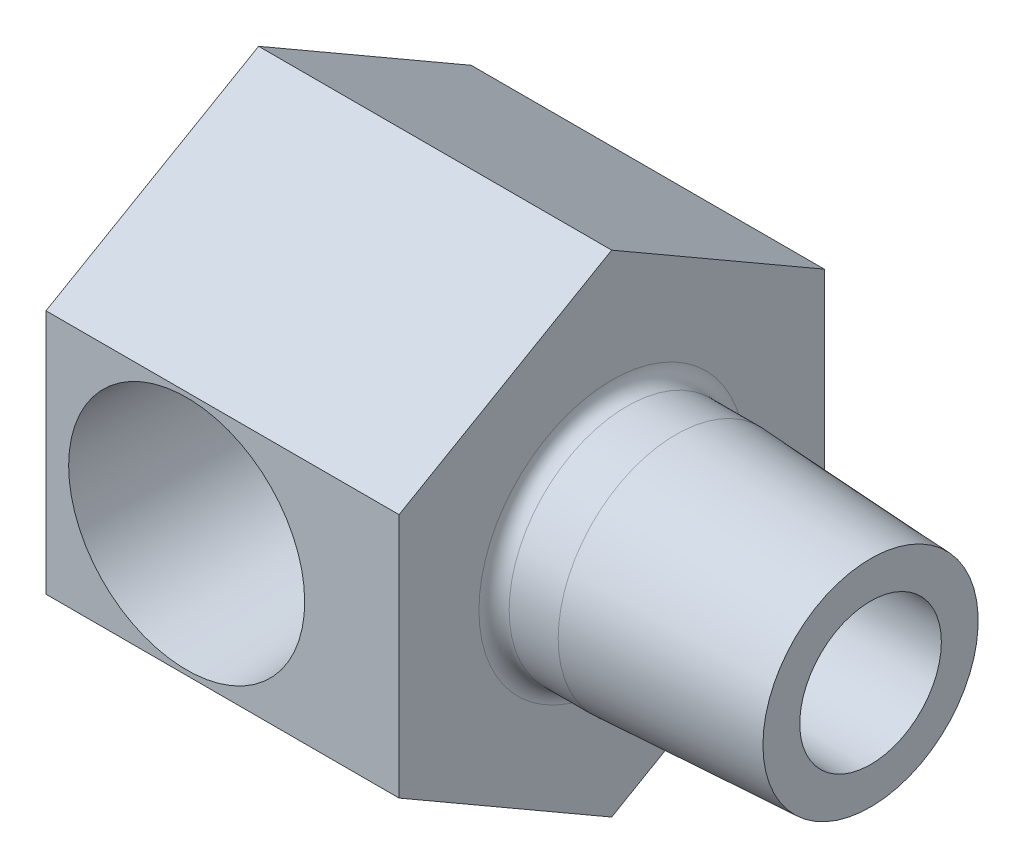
ISO-10303-21;
HEADER;
FILE_DESCRIPTION(('STEP AP214'),'2;1');
FILE_NAME('part.step','',(''),(''),'','','');
FILE_SCHEMA(('AUTOMOTIVE_DESIGN { 1 0 10303 214 1 1 1 1 }'));
ENDSEC;
DATA;
#1=APPLICATION_CONTEXT('core data for automotive mechanical design processes');
#2=APPLICATION_PROTOCOL_DEFINITION('international standard','automotive_design',2000,#1);
#3=PRODUCT_CONTEXT('',#1,'mechanical');
#4=PRODUCT('Part','Part','',(#3));
#5=PRODUCT_RELATED_PRODUCT_CATEGORY('part','',(#4));
#6=PRODUCT_DEFINITION_FORMATION('','',#4);
#7=PRODUCT_DEFINITION_CONTEXT('part definition',#1,'design');
#8=PRODUCT_DEFINITION('design','',#6,#7);
#9=PRODUCT_DEFINITION_SHAPE('','',#8);
#10=(LENGTH_UNIT() NAMED_UNIT(*) SI_UNIT(.MILLI.,.METRE.));
#11=(NAMED_UNIT(*) PLANE_ANGLE_UNIT() SI_UNIT($,.RADIAN.));
#12=(NAMED_UNIT(*) SI_UNIT($,.STERADIAN.) SOLID_ANGLE_UNIT());
#13=UNCERTAINTY_MEASURE_WITH_UNIT(LENGTH_MEASURE(1.E-05),#10,'distance_accuracy_value','');
#14=(GEOMETRIC_REPRESENTATION_CONTEXT(3) GLOBAL_UNCERTAINTY_ASSIGNED_CONTEXT((#13)) GLOBAL_UNIT_ASSIGNED_CONTEXT((#10,
#11,#12)) REPRESENTATION_CONTEXT('',''));
#15=CARTESIAN_POINT('',(0.,0.,0.));
#16=DIRECTION('',(0.,0.,1.));
#17=DIRECTION('',(1.,0.,0.));
#18=AXIS2_PLACEMENT_3D('',#15,#16,#17);
#19=CARTESIAN_POINT('',(6.54292177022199,0.,0.));
#20=DIRECTION('',(-1.,0.,0.));
#21=DIRECTION('',(0.,0.,1.));
#22=AXIS2_PLACEMENT_3D('',#19,#20,#21);
#23=PLANE('',#22);
#24=CARTESIAN_POINT('',(6.54292177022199,0.,0.));
#25=DIRECTION('',(1.,0.,0.));
#26=DIRECTION('',(0.,0.,-1.));
#27=AXIS2_PLACEMENT_3D('',#24,#25,#26);
#28=CIRCLE('',#27,2.38125);
#29=CARTESIAN_POINT('',(6.54292177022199,0.,-2.38125));
#30=VERTEX_POINT('',#29);
#31=EDGE_CURVE('E219',#30,#30,#28,.T.);
#32=ORIENTED_EDGE('',*,*,#31,.F.);
#33=EDGE_LOOP('',(#32));
#34=FACE_BOUND('',#33,.T.);
#35=CARTESIAN_POINT('',(6.54292177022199,0.,0.));
#36=DIRECTION('',(-1.,0.,0.));
#37=DIRECTION('',(0.,0.,1.));
#38=AXIS2_PLACEMENT_3D('',#35,#36,#37);
#39=CIRCLE('',#38,3.6195);
#40=CARTESIAN_POINT('',(6.54292177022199,0.,3.6195));
#41=VERTEX_POINT('',#40);
#42=EDGE_CURVE('E222',#41,#41,#39,.T.);
#43=ORIENTED_EDGE('',*,*,#42,.F.);
#44=EDGE_LOOP('',(#43));
#45=FACE_BOUND('',#44,.T.);
#46=ADVANCED_FACE('F14',(#34,#45),#23,.F.);
#47=CARTESIAN_POINT('',(-9.30032822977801,0.,-2.73832921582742));
#48=DIRECTION('',(0.,0.,1.));
#49=DIRECTION('',(1.,0.,0.));
#50=AXIS2_PLACEMENT_3D('',#47,#48,#49);
#51=CONICAL_SURFACE('',#50,3.175,1.0471975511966);
#52=CARTESIAN_POINT('',(-9.30032822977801,0.,-2.73832921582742));
#53=DIRECTION('',(0.,0.,-1.));
#54=DIRECTION('',(-1.,0.,0.));
#55=AXIS2_PLACEMENT_3D('',#52,#53,#54);
#56=CIRCLE('',#55,3.175);
#57=CARTESIAN_POINT('',(-12.475328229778,0.,-2.73832921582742));
#58=VERTEX_POINT('',#57);
#59=EDGE_CURVE('E216',#58,#58,#56,.T.);
#60=ORIENTED_EDGE('',*,*,#59,.F.);
#61=EDGE_LOOP('',(#60));
#62=FACE_BOUND('',#61,.T.);
#63=CARTESIAN_POINT('',(-9.30032822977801,0.,-4.57141632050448));
#64=VERTEX_POINT('',#63);
#65=VERTEX_LOOP('',#64);
#66=FACE_BOUND('',#65,.T.);
#67=ADVANCED_FACE('F146',(#62,#66),#51,.F.);
#68=CARTESIAN_POINT('',(-9.30032822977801,0.,8.8617196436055));
#69=DIRECTION('',(0.,0.,-1.));
#70=DIRECTION('',(-1.,0.,0.));
#71=AXIS2_PLACEMENT_3D('',#68,#69,#70);
#72=CYLINDRICAL_SURFACE('',#71,3.175);
#73=CARTESIAN_POINT('',(-7.05526419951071,2.24506403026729,0.79375));
#74=CARTESIAN_POINT('',(-7.07063054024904,2.26043135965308,0.750274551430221));
#75=CARTESIAN_POINT('',(-7.08514897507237,2.27463356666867,0.706092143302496));
#76=CARTESIAN_POINT('',(-7.11211136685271,2.30058256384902,0.616331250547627));
#77=CARTESIAN_POINT('',(-7.12455265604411,2.31232620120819,0.570751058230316));
#78=CARTESIAN_POINT('',(-7.15815243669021,2.34364261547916,0.432038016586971));
#79=CARTESIAN_POINT('',(-7.175561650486,2.35927649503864,0.337000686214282));
#80=CARTESIAN_POINT('',(-7.19757103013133,2.37892390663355,0.143481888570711));
#81=CARTESIAN_POINT('',(-7.20207417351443,2.38284942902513,0.0449799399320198));
#82=CARTESIAN_POINT('',(-7.19711092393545,2.37846744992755,-0.151130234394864));
#83=CARTESIAN_POINT('',(-7.18768047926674,2.37019142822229,-0.248740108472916));
#84=CARTESIAN_POINT('',(-7.15800484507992,2.34337709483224,-0.432242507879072));
#85=CARTESIAN_POINT('',(-7.13872166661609,2.32574702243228,-0.51843534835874));
#86=CARTESIAN_POINT('',(-7.09238154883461,2.28180161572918,-0.686513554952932));
#87=CARTESIAN_POINT('',(-7.06530756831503,2.25546722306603,-0.768389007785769));
#88=CARTESIAN_POINT('',(-6.98731820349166,2.17607706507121,-0.976792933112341));
#89=CARTESIAN_POINT('',(-6.9320756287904,2.11660602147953,-1.09925898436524));
#90=CARTESIAN_POINT('',(-6.81619358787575,1.97934786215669,-1.3306727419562));
#91=CARTESIAN_POINT('',(-6.75554344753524,1.90152399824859,-1.43959264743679));
#92=CARTESIAN_POINT('',(-6.63348909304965,1.72635196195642,-1.6458461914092));
#93=CARTESIAN_POINT('',(-6.57210494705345,1.62855746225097,-1.74281458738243));
#94=CARTESIAN_POINT('',(-6.45575897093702,1.41553245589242,-1.91982421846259));
#95=CARTESIAN_POINT('',(-6.40078566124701,1.30033399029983,-1.99989592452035));
#96=CARTESIAN_POINT('',(-6.31222737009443,1.07850015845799,-2.12604138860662));
#97=CARTESIAN_POINT('',(-6.27656345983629,0.974747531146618,-2.17571119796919));
#98=CARTESIAN_POINT('',(-6.21523096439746,0.758545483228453,-2.26017671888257));
#99=CARTESIAN_POINT('',(-6.18955593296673,0.646101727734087,-2.29498202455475));
#100=CARTESIAN_POINT('',(-6.1502995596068,0.414497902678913,-2.34791955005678));
#101=CARTESIAN_POINT('',(-6.13679344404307,0.295300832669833,-2.36594808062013));
#102=CARTESIAN_POINT('',(-6.12352149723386,0.0547983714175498,-2.38366630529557));
#103=CARTESIAN_POINT('',(-6.1237498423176,-0.0665061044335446,-2.38336377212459));
#104=CARTESIAN_POINT('',(-6.13717423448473,-0.294650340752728,-2.36543762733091));
#105=CARTESIAN_POINT('',(-6.14905872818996,-0.401714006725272,-2.34956584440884));
#106=CARTESIAN_POINT('',(-6.18290116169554,-0.611174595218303,-2.30397720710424));
#107=CARTESIAN_POINT('',(-6.20486121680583,-0.713570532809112,-2.2742574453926));
#108=CARTESIAN_POINT('',(-6.25817977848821,-0.914983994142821,-2.20114539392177));
#109=CARTESIAN_POINT('',(-6.28983872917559,-1.01375998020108,-2.15731333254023));
#110=CARTESIAN_POINT('',(-6.36014386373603,-1.20253885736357,-2.05806633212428));
#111=CARTESIAN_POINT('',(-6.39879107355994,-1.29254045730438,-2.0026496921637));
#112=CARTESIAN_POINT('',(-6.4877534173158,-1.47723800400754,-1.8716295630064));
#113=CARTESIAN_POINT('',(-6.53893953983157,-1.57021355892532,-1.79420076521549));
#114=CARTESIAN_POINT('',(-6.64447017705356,-1.74278172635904,-1.62712480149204));
#115=CARTESIAN_POINT('',(-6.69882138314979,-1.82234449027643,-1.53745116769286));
#116=CARTESIAN_POINT('',(-6.78483601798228,-1.93799449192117,-1.38549534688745));
#117=CARTESIAN_POINT('',(-6.81678417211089,-1.978649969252,-1.32680472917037));
#118=CARTESIAN_POINT('',(-6.87940523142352,-2.05479804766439,-1.20552687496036));
#119=CARTESIAN_POINT('',(-6.91007766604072,-2.09028875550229,-1.14293822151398));
#120=CARTESIAN_POINT('',(-6.99839934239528,-2.18847351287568,-0.949607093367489));
#121=CARTESIAN_POINT('',(-7.05261796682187,-2.24321798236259,-0.812860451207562));
#122=CARTESIAN_POINT('',(-7.12289034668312,-2.31101796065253,-0.581315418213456));
#123=CARTESIAN_POINT('',(-7.14558921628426,-2.33200721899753,-0.490836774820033));
#124=CARTESIAN_POINT('',(-7.17999291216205,-2.36333509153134,-0.30613691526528));
#125=CARTESIAN_POINT('',(-7.19172795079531,-2.37370298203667,-0.211926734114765));
#126=CARTESIAN_POINT('',(-7.20230295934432,-2.38306079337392,-0.0217499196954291));
#127=CARTESIAN_POINT('',(-7.20108262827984,-2.3819975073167,0.0742228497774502));
#128=CARTESIAN_POINT('',(-7.18580389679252,-2.36843856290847,0.264544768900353));
#129=CARTESIAN_POINT('',(-7.1717105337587,-2.35591176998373,0.358888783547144));
#130=CARTESIAN_POINT('',(-7.13993777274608,-2.32671680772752,0.510301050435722));
#131=CARTESIAN_POINT('',(-7.12532517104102,-2.31311442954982,0.568673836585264));
#132=CARTESIAN_POINT('',(-7.09266493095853,-2.281962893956,0.682993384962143));
#133=CARTESIAN_POINT('',(-7.07463742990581,-2.26443676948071,0.738952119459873));
#134=CARTESIAN_POINT('',(-7.05526419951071,-2.24506403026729,0.79375));
#135=B_SPLINE_CURVE_WITH_KNOTS('',3,(#73,#74,#75,#76,#77,#78,#79,#80,#81,#82,#83,#84,#85,#86,
#87,#88,#89,#90,#91,#92,#93,#94,#95,#96,#97,#98,#99,#100,#101,#102,#103,#104,#105,#106,#107,
#108,#109,#110,#111,#112,#113,#114,#115,#116,#117,#118,#119,#120,#121,#122,#123,#124,#125,#126,
#127,#128,#129,#130,#131,#132,#133,#134),.UNSPECIFIED.,.F.,.F.,(4,2,2,2,2,2,2,2,2,2,2,2,2,2,2,2,
2,2,2,2,2,2,2,2,2,2,2,2,2,2,4),(0.,0.145766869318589,0.291719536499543,0.583852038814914,
0.878174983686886,1.17173990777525,1.44095267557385,1.71075884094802,2.14913753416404,
2.58840156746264,3.0388403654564,3.48845978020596,3.84830623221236,4.20792007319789,
4.56974203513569,4.93141057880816,5.25656488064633,5.58178747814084,5.91832668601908,
6.25491534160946,6.64763851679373,7.04122443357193,7.27561367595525,7.51008862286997,
7.9772178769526,8.26303342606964,8.54805902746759,8.83441186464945,9.12154474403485,
9.30637335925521,9.49014419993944),.UNSPECIFIED.);
#136=CARTESIAN_POINT('',(-7.05526419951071,2.24506403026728,0.79375));
#137=VERTEX_POINT('',#136);
#138=CARTESIAN_POINT('',(-7.05526419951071,-2.24506403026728,0.79375));
#139=VERTEX_POINT('',#138);
#140=EDGE_CURVE('E9',#137,#139,#135,.T.);
#141=ORIENTED_EDGE('',*,*,#140,.F.);
#142=CARTESIAN_POINT('',(-9.30032822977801,0.,0.79375));
#143=DIRECTION('',(0.,0.,-1.));
#144=DIRECTION('',(-1.,0.,0.));
#145=AXIS2_PLACEMENT_3D('',#142,#143,#144);
#146=CIRCLE('',#145,3.175);
#147=EDGE_CURVE('E211',#139,#137,#146,.T.);
#148=ORIENTED_EDGE('',*,*,#147,.F.);
#149=EDGE_LOOP('',(#141,#148));
#150=FACE_BOUND('',#149,.T.);
#151=ORIENTED_EDGE('',*,*,#59,.T.);
#152=EDGE_LOOP('',(#151));
#153=FACE_BOUND('',#152,.T.);
#154=ADVANCED_FACE('F149',(#150,#153),#72,.F.);
#155=CARTESIAN_POINT('',(-2.15657822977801,4.12811215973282,7.15645));
#156=DIRECTION('',(0.,0.,-1.));
#157=DIRECTION('',(-1.,0.,0.));
#158=AXIS2_PLACEMENT_3D('',#155,#156,#157);
#159=PLANE('',#158);
#160=DIRECTION('',(0.,-1.,0.));
#161=VECTOR('',#160,1.);
#162=CARTESIAN_POINT('',(-14.031078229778,-8.25622431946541,7.15645));
#163=LINE('',#162,#161);
#164=CARTESIAN_POINT('',(-14.031078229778,4.12811215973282,7.15645));
#165=VERTEX_POINT('',#164);
#166=CARTESIAN_POINT('',(-14.031078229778,-4.12811215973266,7.15645));
#167=VERTEX_POINT('',#166);
#168=EDGE_CURVE('E130',#165,#167,#163,.T.);
#169=ORIENTED_EDGE('',*,*,#168,.T.);
#170=DIRECTION('',(-1.,0.,0.));
#171=VECTOR('',#170,1.);
#172=CARTESIAN_POINT('',(-2.15657822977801,-4.12811215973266,7.15645));
#173=LINE('',#172,#171);
#174=CARTESIAN_POINT('',(-2.15657822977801,-4.12811215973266,7.15645));
#175=VERTEX_POINT('',#174);
#176=EDGE_CURVE('E198',#175,#167,#173,.T.);
#177=ORIENTED_EDGE('',*,*,#176,.F.);
#178=DIRECTION('',(0.,-1.,0.));
#179=VECTOR('',#178,1.);
#180=CARTESIAN_POINT('',(-2.15657822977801,4.12811215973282,7.15645));
#181=LINE('',#180,#179);
#182=CARTESIAN_POINT('',(-2.15657822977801,4.12811215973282,7.15645));
#183=VERTEX_POINT('',#182);
#184=EDGE_CURVE('E190',#183,#175,#181,.T.);
#185=ORIENTED_EDGE('',*,*,#184,.F.);
#186=DIRECTION('',(-1.,0.,0.));
#187=VECTOR('',#186,1.);
#188=CARTESIAN_POINT('',(-2.15657822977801,4.12811215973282,7.15645));
#189=LINE('',#188,#187);
#190=EDGE_CURVE('E201',#183,#165,#189,.T.);
#191=ORIENTED_EDGE('',*,*,#190,.T.);
#192=EDGE_LOOP('',(#169,#177,#185,#191));
#193=FACE_BOUND('',#192,.T.);
#194=CARTESIAN_POINT('',(-9.30032822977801,0.,7.15645));
#195=DIRECTION('',(0.,0.,-1.));
#196=DIRECTION('',(-1.,0.,0.));
#197=AXIS2_PLACEMENT_3D('',#194,#195,#196);
#198=CIRCLE('',#197,3.96941557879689);
#199=CARTESIAN_POINT('',(-13.2697438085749,0.,7.15645));
#200=VERTEX_POINT('',#199);
#201=EDGE_CURVE('E121',#200,#200,#198,.T.);
#202=ORIENTED_EDGE('',*,*,#201,.T.);
#203=EDGE_LOOP('',(#202));
#204=FACE_BOUND('',#203,.T.);
#205=ADVANCED_FACE('F158',(#193,#204),#159,.F.);
#206=CARTESIAN_POINT('',(-2.15657822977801,-8.25622431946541,0.00635000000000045));
#207=DIRECTION('',(0.,0.866025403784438,0.5));
#208=DIRECTION('',(0.,-0.5,0.866025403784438));
#209=AXIS2_PLACEMENT_3D('',#206,#207,#208);
#210=PLANE('',#209);
#211=DIRECTION('',(0.,0.5,-0.866025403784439));
#212=VECTOR('',#211,1.);
#213=CARTESIAN_POINT('',(-14.031078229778,-8.25622431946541,0.00635000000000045));
#214=LINE('',#213,#212);
#215=CARTESIAN_POINT('',(-14.031078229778,-8.25622431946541,0.00635000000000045));
#216=VERTEX_POINT('',#215);
#217=CARTESIAN_POINT('',(-14.031078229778,-4.12811215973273,-7.14375));
#218=VERTEX_POINT('',#217);
#219=EDGE_CURVE('E109',#216,#218,#214,.T.);
#220=ORIENTED_EDGE('',*,*,#219,.T.);
#221=DIRECTION('',(-1.,0.,0.));
#222=VECTOR('',#221,1.);
#223=CARTESIAN_POINT('',(-2.15657822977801,-4.12811215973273,-7.14375));
#224=LINE('',#223,#222);
#225=CARTESIAN_POINT('',(-2.15657822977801,-4.12811215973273,-7.14375));
#226=VERTEX_POINT('',#225);
#227=EDGE_CURVE('E88',#226,#218,#224,.T.);
#228=ORIENTED_EDGE('',*,*,#227,.F.);
#229=DIRECTION('',(0.,0.5,-0.866025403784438));
#230=VECTOR('',#229,1.);
#231=CARTESIAN_POINT('',(-2.15657822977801,-8.25622431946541,0.00635000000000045));
#232=LINE('',#231,#230);
#233=CARTESIAN_POINT('',(-2.15657822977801,-8.25622431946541,0.00635000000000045));
#234=VERTEX_POINT('',#233);
#235=EDGE_CURVE('E95',#234,#226,#232,.T.);
#236=ORIENTED_EDGE('',*,*,#235,.F.);
#237=DIRECTION('',(-1.,0.,0.));
#238=VECTOR('',#237,1.);
#239=CARTESIAN_POINT('',(-2.15657822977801,-8.25622431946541,0.00635000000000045));
#240=LINE('',#239,#238);
#241=EDGE_CURVE('E195',#234,#216,#240,.T.);
#242=ORIENTED_EDGE('',*,*,#241,.T.);
#243=EDGE_LOOP('',(#220,#228,#236,#242));
#244=FACE_BOUND('',#243,.T.);
#245=ADVANCED_FACE('F107',(#244),#210,.F.);
#246=CARTESIAN_POINT('',(-2.15657822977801,-4.12811215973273,-7.14375));
#247=DIRECTION('',(0.,0.,1.));
#248=DIRECTION('',(0.,-1.,0.));
#249=AXIS2_PLACEMENT_3D('',#246,#247,#248);
#250=PLANE('',#249);
#251=DIRECTION('',(0.,1.,0.));
#252=VECTOR('',#251,1.);
#253=CARTESIAN_POINT('',(-14.031078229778,-8.25622431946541,-7.14375));
#254=LINE('',#253,#252);
#255=CARTESIAN_POINT('',(-14.031078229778,4.12811215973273,-7.14375));
#256=VERTEX_POINT('',#255);
#257=EDGE_CURVE('E120',#218,#256,#254,.T.);
#258=ORIENTED_EDGE('',*,*,#257,.T.);
#259=DIRECTION('',(-1.,0.,0.));
#260=VECTOR('',#259,1.);
#261=CARTESIAN_POINT('',(-2.15657822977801,4.12811215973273,-7.14375));
#262=LINE('',#261,#260);
#263=CARTESIAN_POINT('',(-2.15657822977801,4.12811215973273,-7.14375));
#264=VERTEX_POINT('',#263);
#265=EDGE_CURVE('E91',#264,#256,#262,.T.);
#266=ORIENTED_EDGE('',*,*,#265,.F.);
#267=DIRECTION('',(0.,1.,0.));
#268=VECTOR('',#267,1.);
#269=CARTESIAN_POINT('',(-2.15657822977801,-4.12811215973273,-7.14375));
#270=LINE('',#269,#268);
#271=EDGE_CURVE('E84',#226,#264,#270,.T.);
#272=ORIENTED_EDGE('',*,*,#271,.F.);
#273=ORIENTED_EDGE('',*,*,#227,.T.);
#274=EDGE_LOOP('',(#258,#266,#272,#273));
#275=FACE_BOUND('',#274,.T.);
#276=ADVANCED_FACE('F86',(#275),#250,.F.);
#277=CARTESIAN_POINT('',(-2.15657822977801,4.12811215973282,-7.14375));
#278=DIRECTION('',(0.,-0.866025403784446,0.499999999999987));
#279=DIRECTION('',(0.,-0.499999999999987,-0.866025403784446));
#280=AXIS2_PLACEMENT_3D('',#277,#278,#279);
#281=PLANE('',#280);
#282=DIRECTION('',(0.,0.499999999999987,0.866025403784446));
#283=VECTOR('',#282,1.);
#284=CARTESIAN_POINT('',(-14.031078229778,4.12811215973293,-7.14374999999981));
#285=LINE('',#284,#283);
#286=CARTESIAN_POINT('',(-14.031078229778,8.25622431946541,0.00635000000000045));
#287=VERTEX_POINT('',#286);
#288=EDGE_CURVE('E124',#256,#287,#285,.T.);
#289=ORIENTED_EDGE('',*,*,#288,.T.);
#290=DIRECTION('',(-1.,0.,0.));
#291=VECTOR('',#290,1.);
#292=CARTESIAN_POINT('',(-2.15657822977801,8.25622431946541,0.00635000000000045));
#293=LINE('',#292,#291);
#294=CARTESIAN_POINT('',(-2.15657822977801,8.25622431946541,0.00635000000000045));
#295=VERTEX_POINT('',#294);
#296=EDGE_CURVE('E114',#295,#287,#293,.T.);
#297=ORIENTED_EDGE('',*,*,#296,.F.);
#298=DIRECTION('',(0.,0.499999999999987,0.866025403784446));
#299=VECTOR('',#298,1.);
#300=CARTESIAN_POINT('',(-2.15657822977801,4.12811215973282,-7.14375));
#301=LINE('',#300,#299);
#302=EDGE_CURVE('E94',#264,#295,#301,.T.);
#303=ORIENTED_EDGE('',*,*,#302,.F.);
#304=ORIENTED_EDGE('',*,*,#265,.T.);
#305=EDGE_LOOP('',(#289,#297,#303,#304));
#306=FACE_BOUND('',#305,.T.);
#307=ADVANCED_FACE('F164',(#306),#281,.F.);
#308=CARTESIAN_POINT('',(-2.15657822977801,8.25622431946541,0.00635000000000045));
#309=DIRECTION('',(0.,-0.866025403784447,-0.499999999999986));
#310=DIRECTION('',(0.,0.499999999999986,-0.866025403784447));
#311=AXIS2_PLACEMENT_3D('',#308,#309,#310);
#312=PLANE('',#311);
#313=DIRECTION('',(0.,-0.499999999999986,0.866025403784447));
#314=VECTOR('',#313,1.);
#315=CARTESIAN_POINT('',(-14.031078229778,4.12811215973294,7.1564499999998));
#316=LINE('',#315,#314);
#317=EDGE_CURVE('E127',#287,#165,#316,.T.);
#318=ORIENTED_EDGE('',*,*,#317,.T.);
#319=ORIENTED_EDGE('',*,*,#190,.F.);
#320=DIRECTION('',(0.,-0.499999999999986,0.866025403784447));
#321=VECTOR('',#320,1.);
#322=CARTESIAN_POINT('',(-2.15657822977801,8.25622431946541,0.00635000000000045));
#323=LINE('',#322,#321);
#324=EDGE_CURVE('E188',#295,#183,#323,.T.);
#325=ORIENTED_EDGE('',*,*,#324,.F.);
#326=ORIENTED_EDGE('',*,*,#296,.T.);
#327=EDGE_LOOP('',(#318,#319,#325,#326));
#328=FACE_BOUND('',#327,.T.);
#329=ADVANCED_FACE('F156',(#328),#312,.F.);
#330=CARTESIAN_POINT('',(-2.15657822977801,-4.12811215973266,7.15645));
#331=DIRECTION('',(0.,0.866025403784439,-0.5));
#332=DIRECTION('',(0.,0.5,0.866025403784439));
#333=AXIS2_PLACEMENT_3D('',#330,#331,#332);
#334=PLANE('',#333);
#335=DIRECTION('',(0.,-0.5,-0.866025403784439));
#336=VECTOR('',#335,1.);
#337=CARTESIAN_POINT('',(-14.031078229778,-8.2562243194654,0.00634999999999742));
#338=LINE('',#337,#336);
#339=EDGE_CURVE('E105',#167,#216,#338,.T.);
#340=ORIENTED_EDGE('',*,*,#339,.T.);
#341=ORIENTED_EDGE('',*,*,#241,.F.);
#342=DIRECTION('',(0.,-0.5,-0.866025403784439));
#343=VECTOR('',#342,1.);
#344=CARTESIAN_POINT('',(-2.15657822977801,-4.12811215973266,7.15645));
#345=LINE('',#344,#343);
#346=EDGE_CURVE('E101',#175,#234,#345,.T.);
#347=ORIENTED_EDGE('',*,*,#346,.F.);
#348=ORIENTED_EDGE('',*,*,#176,.T.);
#349=EDGE_LOOP('',(#340,#341,#347,#348));
#350=FACE_BOUND('',#349,.T.);
#351=ADVANCED_FACE('F153',(#350),#334,.F.);
#352=CARTESIAN_POINT('',(-2.15657822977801,-8.25622431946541,0.00635000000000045));
#353=DIRECTION('',(-1.,0.,0.));
#354=DIRECTION('',(0.,-1.,0.));
#355=AXIS2_PLACEMENT_3D('',#352,#353,#354);
#356=PLANE('',#355);
#357=ORIENTED_EDGE('',*,*,#235,.T.);
#358=ORIENTED_EDGE('',*,*,#271,.T.);
#359=ORIENTED_EDGE('',*,*,#302,.T.);
#360=ORIENTED_EDGE('',*,*,#324,.T.);
#361=ORIENTED_EDGE('',*,*,#184,.T.);
#362=ORIENTED_EDGE('',*,*,#346,.T.);
#363=EDGE_LOOP('',(#357,#358,#359,#360,#361,#362));
#364=FACE_BOUND('',#363,.T.);
#365=CARTESIAN_POINT('',(-2.15657822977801,0.,0.));
#366=DIRECTION('',(-1.,0.,0.));
#367=DIRECTION('',(0.,0.,1.));
#368=AXIS2_PLACEMENT_3D('',#365,#366,#367);
#369=CIRCLE('',#368,4.4704);
#370=CARTESIAN_POINT('',(-2.15657822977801,0.,4.4704));
#371=VERTEX_POINT('',#370);
#372=EDGE_CURVE('E231',#371,#371,#369,.T.);
#373=ORIENTED_EDGE('',*,*,#372,.T.);
#374=EDGE_LOOP('',(#373));
#375=FACE_BOUND('',#374,.T.);
#376=ADVANCED_FACE('F98',(#364,#375),#356,.F.);
#377=CARTESIAN_POINT('',(-14.031078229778,-8.25622431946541,0.00635000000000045));
#378=DIRECTION('',(-1.,0.,0.));
#379=DIRECTION('',(0.,-1.,0.));
#380=AXIS2_PLACEMENT_3D('',#377,#378,#379);
#381=PLANE('',#380);
#382=ORIENTED_EDGE('',*,*,#219,.F.);
#383=ORIENTED_EDGE('',*,*,#339,.F.);
#384=ORIENTED_EDGE('',*,*,#168,.F.);
#385=ORIENTED_EDGE('',*,*,#317,.F.);
#386=ORIENTED_EDGE('',*,*,#288,.F.);
#387=ORIENTED_EDGE('',*,*,#257,.F.);
#388=EDGE_LOOP('',(#382,#383,#384,#385,#386,#387));
#389=FACE_BOUND('',#388,.T.);
#390=ADVANCED_FACE('F145',(#389),#381,.T.);
#391=CARTESIAN_POINT('',(-9.30032822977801,0.,7.15645));
#392=DIRECTION('',(0.,0.,1.));
#393=DIRECTION('',(1.,0.,0.));
#394=AXIS2_PLACEMENT_3D('',#391,#392,#393);
#395=CONICAL_SURFACE('',#394,3.96941557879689,0.0523598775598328);
#396=CARTESIAN_POINT('',(-6.44034513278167,-2.24513473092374,0.79355));
#397=CARTESIAN_POINT('',(-6.41704156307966,-2.22119984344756,0.861237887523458));
#398=CARTESIAN_POINT('',(-6.39218730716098,-2.19440722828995,0.927326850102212));
#399=CARTESIAN_POINT('',(-6.3402861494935,-2.1354274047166,1.05608896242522));
#400=CARTESIAN_POINT('',(-6.31324096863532,-2.10324440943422,1.11876472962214));
#401=CARTESIAN_POINT('',(-6.25775245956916,-2.03367222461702,1.24075366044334));
#402=CARTESIAN_POINT('',(-6.22930553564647,-1.99626914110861,1.3000572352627));
#403=CARTESIAN_POINT('',(-6.17186046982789,-1.91653771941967,1.41496554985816));
#404=CARTESIAN_POINT('',(-6.14286220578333,-1.87420827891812,1.47056945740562));
#405=CARTESIAN_POINT('',(-6.05625723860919,-1.74027894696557,1.6313205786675));
#406=CARTESIAN_POINT('',(-5.99886361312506,-1.64152548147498,1.73077824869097));
#407=CARTESIAN_POINT('',(-5.89005498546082,-1.42630272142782,1.91200042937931));
#408=CARTESIAN_POINT('',(-5.83863080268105,-1.30986128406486,1.99379228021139));
#409=CARTESIAN_POINT('',(-5.75534631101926,-1.08459227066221,2.1230926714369));
#410=CARTESIAN_POINT('',(-5.72162530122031,-0.978504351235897,2.17416082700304));
#411=CARTESIAN_POINT('',(-5.66382995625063,-0.757639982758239,2.26061189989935));
#412=CARTESIAN_POINT('',(-5.63974855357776,-0.642869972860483,2.29600631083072));
#413=CARTESIAN_POINT('',(-5.60322933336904,-0.406813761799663,2.34937533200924));
#414=CARTESIAN_POINT('',(-5.59085632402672,-0.2854951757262,2.36725300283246));
#415=CARTESIAN_POINT('',(-5.57923747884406,-0.0409258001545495,2.38404740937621));
#416=CARTESIAN_POINT('',(-5.5799877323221,0.0823244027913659,2.38296979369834));
#417=CARTESIAN_POINT('',(-5.59383581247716,0.31502143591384,2.36293864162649));
#418=CARTESIAN_POINT('',(-5.60578187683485,0.424688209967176,2.34565246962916));
#419=CARTESIAN_POINT('',(-5.63939495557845,0.639118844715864,2.29651521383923));
#420=CARTESIAN_POINT('',(-5.66106257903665,0.743882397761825,2.26466321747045));
#421=CARTESIAN_POINT('',(-5.71343944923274,0.949860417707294,2.18647784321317));
#422=CARTESIAN_POINT('',(-5.74444028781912,1.05081989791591,2.13967390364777));
#423=CARTESIAN_POINT('',(-5.81306943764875,1.24358099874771,2.03370971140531));
#424=CARTESIAN_POINT('',(-5.85070223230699,1.33537635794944,1.97454109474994));
#425=CARTESIAN_POINT('',(-5.93650251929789,1.52215980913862,1.8354680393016));
#426=CARTESIAN_POINT('',(-5.98540049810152,1.61547812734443,1.75377511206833));
#427=CARTESIAN_POINT('',(-6.08559729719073,1.78776934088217,1.57778802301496));
#428=CARTESIAN_POINT('',(-6.1368963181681,1.86674103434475,1.48349280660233));
#429=CARTESIAN_POINT('',(-6.23285972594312,2.0020629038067,1.29390373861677));
#430=CARTESIAN_POINT('',(-6.27765509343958,2.0599177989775,1.19975477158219));
#431=CARTESIAN_POINT('',(-6.34168532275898,2.13691697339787,1.05214810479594));
#432=CARTESIAN_POINT('',(-6.36250052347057,2.16095176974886,1.0018849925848));
#433=CARTESIAN_POINT('',(-6.4026488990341,2.20562966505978,0.899265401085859));
#434=CARTESIAN_POINT('',(-6.42198120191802,2.22627077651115,0.846907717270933));
#435=CARTESIAN_POINT('',(-6.44034513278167,2.24513473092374,0.79355));
#436=B_SPLINE_CURVE_WITH_KNOTS('',3,(#396,#397,#398,#399,#400,#401,#402,#403,#404,#405,#406,
#407,#408,#409,#410,#411,#412,#413,#414,#415,#416,#417,#418,#419,#420,#421,#422,#423,#424,#425,
#426,#427,#428,#429,#430,#431,#432,#433,#434,#435),.UNSPECIFIED.,.F.,.F.,(4,2,2,2,2,2,2,2,2,2,2,
2,2,2,2,2,2,2,2,4),(0.,0.226289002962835,0.452401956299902,0.679128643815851,0.905906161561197,
1.35808910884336,1.80956714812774,2.17547721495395,2.54111851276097,2.90877206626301,
3.27631606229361,3.60976826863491,3.94324136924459,4.28846043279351,4.63391377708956,
5.03235206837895,5.43082372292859,5.78744774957,5.96573988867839,6.14413607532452),.UNSPECIFIED.);
#437=CARTESIAN_POINT('',(-6.44027630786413,-2.24506403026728,0.79375));
#438=VERTEX_POINT('',#437);
#439=CARTESIAN_POINT('',(-6.44027630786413,2.24506403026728,0.79375));
#440=VERTEX_POINT('',#439);
#441=EDGE_CURVE('E27',#438,#440,#436,.T.);
#442=ORIENTED_EDGE('',*,*,#441,.F.);
#443=CARTESIAN_POINT('',(-9.30032822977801,0.,0.79375));
#444=DIRECTION('',(0.,0.,-1.));
#445=DIRECTION('',(-1.,0.,0.));
#446=AXIS2_PLACEMENT_3D('',#443,#444,#445);
#447=CIRCLE('',#446,3.63596060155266);
#448=EDGE_CURVE('E210',#438,#440,#447,.T.);
#449=ORIENTED_EDGE('',*,*,#448,.T.);
#450=EDGE_LOOP('',(#442,#449));
#451=FACE_BOUND('',#450,.T.);
#452=ORIENTED_EDGE('',*,*,#201,.F.);
#453=EDGE_LOOP('',(#452));
#454=FACE_BOUND('',#453,.T.);
#455=ADVANCED_FACE('F139',(#451,#454),#395,.F.);
#456=CARTESIAN_POINT('',(-6.12532822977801,0.,0.79375));
#457=DIRECTION('',(0.,0.,1.));
#458=DIRECTION('',(1.,0.,0.));
#459=AXIS2_PLACEMENT_3D('',#456,#457,#458);
#460=PLANE('',#459);
#461=DIRECTION('',(1.,0.,0.));
#462=VECTOR('',#461,1.);
#463=CARTESIAN_POINT('',(-1.07707822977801,-2.24506403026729,0.79375));
#464=LINE('',#463,#462);
#465=EDGE_CURVE('E112',#139,#438,#464,.T.);
#466=ORIENTED_EDGE('',*,*,#465,.F.);
#467=ORIENTED_EDGE('',*,*,#147,.T.);
#468=DIRECTION('',(1.,0.,0.));
#469=VECTOR('',#468,1.);
#470=CARTESIAN_POINT('',(-1.07707822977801,2.24506403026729,0.79375));
#471=LINE('',#470,#469);
#472=EDGE_CURVE('E110',#440,#137,#471,.F.);
#473=ORIENTED_EDGE('',*,*,#472,.F.);
#474=ORIENTED_EDGE('',*,*,#448,.F.);
#475=EDGE_LOOP('',(#466,#467,#473,#474));
#476=FACE_BOUND('',#475,.T.);
#477=ADVANCED_FACE('F144',(#476),#460,.T.);
#478=CARTESIAN_POINT('',(-1.07707822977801,0.,0.));
#479=DIRECTION('',(1.,0.,0.));
#480=DIRECTION('',(0.,0.,-1.));
#481=AXIS2_PLACEMENT_3D('',#478,#479,#480);
#482=CYLINDRICAL_SURFACE('',#481,2.38125);
#483=ORIENTED_EDGE('',*,*,#31,.T.);
#484=EDGE_LOOP('',(#483));
#485=FACE_BOUND('',#484,.T.);
#486=ORIENTED_EDGE('',*,*,#441,.T.);
#487=ORIENTED_EDGE('',*,*,#472,.T.);
#488=ORIENTED_EDGE('',*,*,#140,.T.);
#489=ORIENTED_EDGE('',*,*,#465,.T.);
#490=EDGE_LOOP('',(#486,#487,#488,#489));
#491=FACE_BOUND('',#490,.T.);
#492=ADVANCED_FACE('F16',(#485,#491),#482,.F.);
#493=CARTESIAN_POINT('',(0.,0.,0.));
#494=DIRECTION('',(-1.,0.,0.));
#495=DIRECTION('',(0.,0.,1.));
#496=AXIS2_PLACEMENT_3D('',#493,#494,#495);
#497=CONICAL_SURFACE('',#496,3.9624,0.05235987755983);
#498=ORIENTED_EDGE('',*,*,#42,.T.);
#499=EDGE_LOOP('',(#498));
#500=FACE_BOUND('',#499,.T.);
#501=CARTESIAN_POINT('',(0.,0.,0.));
#502=DIRECTION('',(-1.,0.,0.));
#503=DIRECTION('',(0.,0.,1.));
#504=AXIS2_PLACEMENT_3D('',#501,#502,#503);
#505=CIRCLE('',#504,3.9624);
#506=CARTESIAN_POINT('',(0.,0.,3.9624));
#507=VERTEX_POINT('',#506);
#508=EDGE_CURVE('E225',#507,#507,#505,.T.);
#509=ORIENTED_EDGE('',*,*,#508,.F.);
#510=EDGE_LOOP('',(#509));
#511=FACE_BOUND('',#510,.T.);
#512=ADVANCED_FACE('F244',(#500,#511),#497,.T.);
#513=CARTESIAN_POINT('',(7.36842177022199,0.,0.));
#514=DIRECTION('',(-1.,0.,0.));
#515=DIRECTION('',(0.,0.,1.));
#516=AXIS2_PLACEMENT_3D('',#513,#514,#515);
#517=CYLINDRICAL_SURFACE('',#516,3.9624);
#518=ORIENTED_EDGE('',*,*,#508,.T.);
#519=EDGE_LOOP('',(#518));
#520=FACE_BOUND('',#519,.T.);
#521=CARTESIAN_POINT('',(-1.64857822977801,0.,0.));
#522=DIRECTION('',(-1.,0.,0.));
#523=DIRECTION('',(0.,0.,1.));
#524=AXIS2_PLACEMENT_3D('',#521,#522,#523);
#525=CIRCLE('',#524,3.9624);
#526=CARTESIAN_POINT('',(-1.64857822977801,0.,3.9624));
#527=VERTEX_POINT('',#526);
#528=EDGE_CURVE('E228',#527,#527,#525,.T.);
#529=ORIENTED_EDGE('',*,*,#528,.F.);
#530=EDGE_LOOP('',(#529));
#531=FACE_BOUND('',#530,.T.);
#532=ADVANCED_FACE('F237',(#520,#531),#517,.T.);
#533=CARTESIAN_POINT('',(-1.64857822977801,0.,0.));
#534=DIRECTION('',(-1.,0.,0.));
#535=DIRECTION('',(0.,0.,1.));
#536=AXIS2_PLACEMENT_3D('',#533,#534,#535);
#537=TOROIDAL_SURFACE('',#536,4.4704,0.508);
#538=ORIENTED_EDGE('',*,*,#528,.T.);
#539=EDGE_LOOP('',(#538));
#540=FACE_BOUND('',#539,.T.);
#541=ORIENTED_EDGE('',*,*,#372,.F.);
#542=EDGE_LOOP('',(#541));
#543=FACE_BOUND('',#542,.T.);
#544=ADVANCED_FACE('F235',(#540,#543),#537,.F.);
#545=CLOSED_SHELL('',(#46,#67,#154,#205,#245,#276,#307,#329,#351,#376,#390,#455,#477,#492,#512,
#532,#544));
#546=MANIFOLD_SOLID_BREP('B1',#545);
#547=ADVANCED_BREP_SHAPE_REPRESENTATION('',(#18,#546),#14);
#548=SHAPE_DEFINITION_REPRESENTATION(#9,#547);
ENDSEC;
END-ISO-10303-21;
